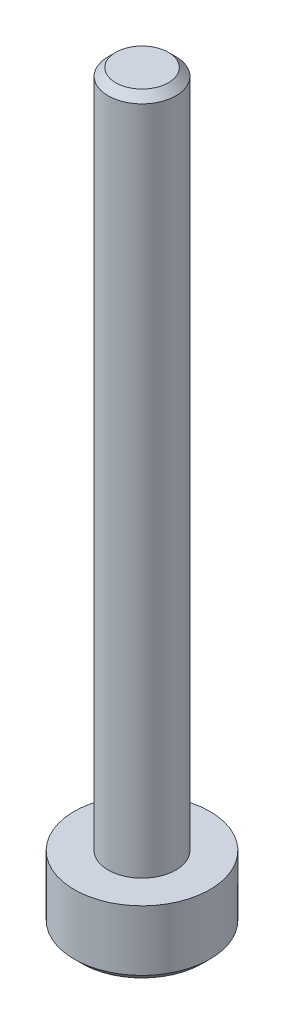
ISO-10303-21;
HEADER;
FILE_DESCRIPTION(('STEP AP214'),'2;1');
FILE_NAME('part.step','',(''),(''),'','','');
FILE_SCHEMA(('AUTOMOTIVE_DESIGN { 1 0 10303 214 1 1 1 1 }'));
ENDSEC;
DATA;
#1=APPLICATION_CONTEXT('core data for automotive mechanical design processes');
#2=APPLICATION_PROTOCOL_DEFINITION('international standard','automotive_design',2000,#1);
#3=PRODUCT_CONTEXT('',#1,'mechanical');
#4=PRODUCT('Part','Part','',(#3));
#5=PRODUCT_RELATED_PRODUCT_CATEGORY('part','',(#4));
#6=PRODUCT_DEFINITION_FORMATION('','',#4);
#7=PRODUCT_DEFINITION_CONTEXT('part definition',#1,'design');
#8=PRODUCT_DEFINITION('design','',#6,#7);
#9=PRODUCT_DEFINITION_SHAPE('','',#8);
#10=(LENGTH_UNIT() NAMED_UNIT(*) SI_UNIT(.MILLI.,.METRE.));
#11=(NAMED_UNIT(*) PLANE_ANGLE_UNIT() SI_UNIT($,.RADIAN.));
#12=(NAMED_UNIT(*) SI_UNIT($,.STERADIAN.) SOLID_ANGLE_UNIT());
#13=UNCERTAINTY_MEASURE_WITH_UNIT(LENGTH_MEASURE(1.E-05),#10,'distance_accuracy_value','');
#14=(GEOMETRIC_REPRESENTATION_CONTEXT(3) GLOBAL_UNCERTAINTY_ASSIGNED_CONTEXT((#13)) GLOBAL_UNIT_ASSIGNED_CONTEXT((#10,
#11,#12)) REPRESENTATION_CONTEXT('',''));
#15=CARTESIAN_POINT('',(0.,0.,0.));
#16=DIRECTION('',(0.,0.,1.));
#17=DIRECTION('',(1.,0.,0.));
#18=AXIS2_PLACEMENT_3D('',#15,#16,#17);
#19=CARTESIAN_POINT('',(0.,30.,0.));
#20=DIRECTION('',(0.,-1.,0.));
#21=DIRECTION('',(0.,0.,-1.));
#22=AXIS2_PLACEMENT_3D('',#19,#20,#21);
#23=CYLINDRICAL_SURFACE('',#22,1.5);
#24=CARTESIAN_POINT('',(0.,29.6666666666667,0.));
#25=DIRECTION('',(0.,1.,0.));
#26=DIRECTION('',(0.,0.,1.));
#27=AXIS2_PLACEMENT_3D('',#24,#25,#26);
#28=CIRCLE('',#27,1.5);
#29=CARTESIAN_POINT('',(0.,29.6666666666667,1.5));
#30=VERTEX_POINT('',#29);
#31=EDGE_CURVE('E160',#30,#30,#28,.F.);
#32=ORIENTED_EDGE('',*,*,#31,.T.);
#33=EDGE_LOOP('',(#32));
#34=FACE_BOUND('',#33,.T.);
#35=CARTESIAN_POINT('',(0.,0.,0.));
#36=DIRECTION('',(0.,1.,0.));
#37=DIRECTION('',(0.,0.,1.));
#38=AXIS2_PLACEMENT_3D('',#35,#36,#37);
#39=CIRCLE('',#38,1.5);
#40=CARTESIAN_POINT('',(0.,0.,1.5));
#41=VERTEX_POINT('',#40);
#42=EDGE_CURVE('E154',#41,#41,#39,.T.);
#43=ORIENTED_EDGE('',*,*,#42,.T.);
#44=EDGE_LOOP('',(#43));
#45=FACE_BOUND('',#44,.T.);
#46=ADVANCED_FACE('F43',(#34,#45),#23,.T.);
#47=CARTESIAN_POINT('',(0.,30.,0.));
#48=DIRECTION('',(0.,1.,0.));
#49=DIRECTION('',(0.,0.,1.));
#50=AXIS2_PLACEMENT_3D('',#47,#48,#49);
#51=PLANE('',#50);
#52=CARTESIAN_POINT('',(0.,30.,0.));
#53=DIRECTION('',(0.,1.,0.));
#54=DIRECTION('',(0.,0.,1.));
#55=AXIS2_PLACEMENT_3D('',#52,#53,#54);
#56=CIRCLE('',#55,1.16666666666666);
#57=CARTESIAN_POINT('',(0.,30.,1.16666666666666));
#58=VERTEX_POINT('',#57);
#59=EDGE_CURVE('E157',#58,#58,#56,.T.);
#60=ORIENTED_EDGE('',*,*,#59,.T.);
#61=EDGE_LOOP('',(#60));
#62=FACE_BOUND('',#61,.T.);
#63=ADVANCED_FACE('F177',(#62),#51,.T.);
#64=CARTESIAN_POINT('',(0.,-3.,0.));
#65=DIRECTION('',(0.,1.,0.));
#66=DIRECTION('',(0.,0.,1.));
#67=AXIS2_PLACEMENT_3D('',#64,#65,#66);
#68=CYLINDRICAL_SURFACE('',#67,3.);
#69=CARTESIAN_POINT('',(0.,-2.66666666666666,0.));
#70=DIRECTION('',(0.,-1.,0.));
#71=DIRECTION('',(0.,0.,-1.));
#72=AXIS2_PLACEMENT_3D('',#69,#70,#71);
#73=CIRCLE('',#72,3.);
#74=CARTESIAN_POINT('',(0.,-2.66666666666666,-3.));
#75=VERTEX_POINT('',#74);
#76=EDGE_CURVE('E11',#75,#75,#73,.F.);
#77=ORIENTED_EDGE('',*,*,#76,.T.);
#78=EDGE_LOOP('',(#77));
#79=FACE_BOUND('',#78,.T.);
#80=CARTESIAN_POINT('',(0.,0.,0.));
#81=DIRECTION('',(0.,-1.,0.));
#82=DIRECTION('',(0.,0.,-1.));
#83=AXIS2_PLACEMENT_3D('',#80,#81,#82);
#84=CIRCLE('',#83,3.);
#85=CARTESIAN_POINT('',(0.,0.,-3.));
#86=VERTEX_POINT('',#85);
#87=EDGE_CURVE('E146',#86,#86,#84,.T.);
#88=ORIENTED_EDGE('',*,*,#87,.T.);
#89=EDGE_LOOP('',(#88));
#90=FACE_BOUND('',#89,.T.);
#91=ADVANCED_FACE('F183',(#79,#90),#68,.T.);
#92=CARTESIAN_POINT('',(0.,-3.,0.));
#93=DIRECTION('',(0.,-1.,0.));
#94=DIRECTION('',(0.,0.,-1.));
#95=AXIS2_PLACEMENT_3D('',#92,#93,#94);
#96=PLANE('',#95);
#97=CARTESIAN_POINT('',(0.,-3.,0.));
#98=DIRECTION('',(0.,-1.,0.));
#99=DIRECTION('',(0.,0.,-1.));
#100=AXIS2_PLACEMENT_3D('',#97,#98,#99);
#101=CIRCLE('',#100,2.66666666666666);
#102=CARTESIAN_POINT('',(0.,-3.,-2.66666666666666));
#103=VERTEX_POINT('',#102);
#104=EDGE_CURVE('E52',#103,#103,#101,.T.);
#105=ORIENTED_EDGE('',*,*,#104,.T.);
#106=EDGE_LOOP('',(#105));
#107=FACE_BOUND('',#106,.T.);
#108=DIRECTION('',(-0.866025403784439,0.,0.5));
#109=VECTOR('',#108,1.);
#110=CARTESIAN_POINT('',(1.5,-3.,0.86602540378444));
#111=LINE('',#110,#109);
#112=CARTESIAN_POINT('',(1.5,-3.,0.86602540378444));
#113=VERTEX_POINT('',#112);
#114=CARTESIAN_POINT('',(0.,-3.,1.73205080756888));
#115=VERTEX_POINT('',#114);
#116=EDGE_CURVE('E59',#113,#115,#111,.T.);
#117=ORIENTED_EDGE('',*,*,#116,.F.);
#118=DIRECTION('',(0.,0.,1.));
#119=VECTOR('',#118,1.);
#120=CARTESIAN_POINT('',(1.5,-3.,-0.866025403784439));
#121=LINE('',#120,#119);
#122=CARTESIAN_POINT('',(1.5,-3.,-0.866025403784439));
#123=VERTEX_POINT('',#122);
#124=EDGE_CURVE('E142',#123,#113,#121,.T.);
#125=ORIENTED_EDGE('',*,*,#124,.F.);
#126=DIRECTION('',(0.866025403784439,0.,0.5));
#127=VECTOR('',#126,1.);
#128=CARTESIAN_POINT('',(0.,-3.,-1.73205080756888));
#129=LINE('',#128,#127);
#130=CARTESIAN_POINT('',(0.,-3.,-1.73205080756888));
#131=VERTEX_POINT('',#130);
#132=EDGE_CURVE('E140',#131,#123,#129,.T.);
#133=ORIENTED_EDGE('',*,*,#132,.F.);
#134=DIRECTION('',(0.866025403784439,0.,-0.5));
#135=VECTOR('',#134,1.);
#136=CARTESIAN_POINT('',(-1.5,-3.,-0.866025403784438));
#137=LINE('',#136,#135);
#138=CARTESIAN_POINT('',(-1.5,-3.,-0.866025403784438));
#139=VERTEX_POINT('',#138);
#140=EDGE_CURVE('E107',#139,#131,#137,.T.);
#141=ORIENTED_EDGE('',*,*,#140,.F.);
#142=DIRECTION('',(0.,0.,-1.));
#143=VECTOR('',#142,1.);
#144=CARTESIAN_POINT('',(-1.5,-3.,0.86602540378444));
#145=LINE('',#144,#143);
#146=CARTESIAN_POINT('',(-1.5,-3.,0.86602540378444));
#147=VERTEX_POINT('',#146);
#148=EDGE_CURVE('E136',#147,#139,#145,.T.);
#149=ORIENTED_EDGE('',*,*,#148,.F.);
#150=DIRECTION('',(-0.866025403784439,0.,-0.5));
#151=VECTOR('',#150,1.);
#152=CARTESIAN_POINT('',(0.,-3.,1.73205080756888));
#153=LINE('',#152,#151);
#154=EDGE_CURVE('E133',#115,#147,#153,.T.);
#155=ORIENTED_EDGE('',*,*,#154,.F.);
#156=EDGE_LOOP('',(#117,#125,#133,#141,#149,#155));
#157=FACE_BOUND('',#156,.T.);
#158=ADVANCED_FACE('F165',(#107,#157),#96,.T.);
#159=CARTESIAN_POINT('',(0.,0.,0.));
#160=DIRECTION('',(0.,-1.,0.));
#161=DIRECTION('',(0.,0.,-1.));
#162=AXIS2_PLACEMENT_3D('',#159,#160,#161);
#163=PLANE('',#162);
#164=ORIENTED_EDGE('',*,*,#42,.F.);
#165=EDGE_LOOP('',(#164));
#166=FACE_BOUND('',#165,.T.);
#167=ORIENTED_EDGE('',*,*,#87,.F.);
#168=EDGE_LOOP('',(#167));
#169=FACE_BOUND('',#168,.T.);
#170=ADVANCED_FACE('F196',(#166,#169),#163,.F.);
#171=CARTESIAN_POINT('',(1.5,-1.,0.86602540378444));
#172=DIRECTION('',(0.5,0.,0.866025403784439));
#173=DIRECTION('',(0.866025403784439,0.,-0.5));
#174=AXIS2_PLACEMENT_3D('',#171,#172,#173);
#175=PLANE('',#174);
#176=ORIENTED_EDGE('',*,*,#116,.T.);
#177=DIRECTION('',(0.,-1.,0.));
#178=VECTOR('',#177,1.);
#179=CARTESIAN_POINT('',(0.,-1.,1.73205080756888));
#180=LINE('',#179,#178);
#181=CARTESIAN_POINT('',(0.,-1.,1.73205080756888));
#182=VERTEX_POINT('',#181);
#183=EDGE_CURVE('E89',#182,#115,#180,.T.);
#184=ORIENTED_EDGE('',*,*,#183,.F.);
#185=DIRECTION('',(-0.866025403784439,0.,0.5));
#186=VECTOR('',#185,1.);
#187=CARTESIAN_POINT('',(1.5,-1.,0.86602540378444));
#188=LINE('',#187,#186);
#189=CARTESIAN_POINT('',(1.5,-1.,0.86602540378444));
#190=VERTEX_POINT('',#189);
#191=EDGE_CURVE('E144',#190,#182,#188,.T.);
#192=ORIENTED_EDGE('',*,*,#191,.F.);
#193=DIRECTION('',(0.,-1.,0.));
#194=VECTOR('',#193,1.);
#195=CARTESIAN_POINT('',(1.5,-1.,0.86602540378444));
#196=LINE('',#195,#194);
#197=EDGE_CURVE('E67',#190,#113,#196,.T.);
#198=ORIENTED_EDGE('',*,*,#197,.T.);
#199=EDGE_LOOP('',(#176,#184,#192,#198));
#200=FACE_BOUND('',#199,.T.);
#201=ADVANCED_FACE('F199',(#200),#175,.F.);
#202=CARTESIAN_POINT('',(1.5,-1.,-0.866025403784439));
#203=DIRECTION('',(1.,0.,0.));
#204=DIRECTION('',(0.,0.,-1.));
#205=AXIS2_PLACEMENT_3D('',#202,#203,#204);
#206=PLANE('',#205);
#207=ORIENTED_EDGE('',*,*,#124,.T.);
#208=ORIENTED_EDGE('',*,*,#197,.F.);
#209=DIRECTION('',(0.,0.,1.));
#210=VECTOR('',#209,1.);
#211=CARTESIAN_POINT('',(1.5,-1.,-0.866025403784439));
#212=LINE('',#211,#210);
#213=CARTESIAN_POINT('',(1.5,-1.,-0.866025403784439));
#214=VERTEX_POINT('',#213);
#215=EDGE_CURVE('E119',#214,#190,#212,.T.);
#216=ORIENTED_EDGE('',*,*,#215,.F.);
#217=DIRECTION('',(0.,-1.,0.));
#218=VECTOR('',#217,1.);
#219=CARTESIAN_POINT('',(1.5,-1.,-0.866025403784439));
#220=LINE('',#219,#218);
#221=EDGE_CURVE('E111',#214,#123,#220,.T.);
#222=ORIENTED_EDGE('',*,*,#221,.T.);
#223=EDGE_LOOP('',(#207,#208,#216,#222));
#224=FACE_BOUND('',#223,.T.);
#225=ADVANCED_FACE('F205',(#224),#206,.F.);
#226=CARTESIAN_POINT('',(0.,-1.,-1.73205080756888));
#227=DIRECTION('',(0.5,0.,-0.866025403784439));
#228=DIRECTION('',(-0.866025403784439,0.,-0.5));
#229=AXIS2_PLACEMENT_3D('',#226,#227,#228);
#230=PLANE('',#229);
#231=ORIENTED_EDGE('',*,*,#132,.T.);
#232=ORIENTED_EDGE('',*,*,#221,.F.);
#233=DIRECTION('',(0.866025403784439,0.,0.5));
#234=VECTOR('',#233,1.);
#235=CARTESIAN_POINT('',(0.,-1.,-1.73205080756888));
#236=LINE('',#235,#234);
#237=CARTESIAN_POINT('',(0.,-1.,-1.73205080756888));
#238=VERTEX_POINT('',#237);
#239=EDGE_CURVE('E115',#238,#214,#236,.T.);
#240=ORIENTED_EDGE('',*,*,#239,.F.);
#241=DIRECTION('',(0.,-1.,0.));
#242=VECTOR('',#241,1.);
#243=CARTESIAN_POINT('',(0.,-1.,-1.73205080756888));
#244=LINE('',#243,#242);
#245=EDGE_CURVE('E100',#238,#131,#244,.T.);
#246=ORIENTED_EDGE('',*,*,#245,.T.);
#247=EDGE_LOOP('',(#231,#232,#240,#246));
#248=FACE_BOUND('',#247,.T.);
#249=ADVANCED_FACE('F116',(#248),#230,.F.);
#250=CARTESIAN_POINT('',(-1.5,-1.,-0.866025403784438));
#251=DIRECTION('',(-0.5,0.,-0.866025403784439));
#252=DIRECTION('',(-0.866025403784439,0.,0.5));
#253=AXIS2_PLACEMENT_3D('',#250,#251,#252);
#254=PLANE('',#253);
#255=ORIENTED_EDGE('',*,*,#140,.T.);
#256=ORIENTED_EDGE('',*,*,#245,.F.);
#257=DIRECTION('',(0.866025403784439,0.,-0.5));
#258=VECTOR('',#257,1.);
#259=CARTESIAN_POINT('',(-1.5,-1.,-0.866025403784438));
#260=LINE('',#259,#258);
#261=CARTESIAN_POINT('',(-1.5,-1.,-0.866025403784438));
#262=VERTEX_POINT('',#261);
#263=EDGE_CURVE('E104',#262,#238,#260,.T.);
#264=ORIENTED_EDGE('',*,*,#263,.F.);
#265=DIRECTION('',(0.,-1.,0.));
#266=VECTOR('',#265,1.);
#267=CARTESIAN_POINT('',(-1.5,-1.,-0.866025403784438));
#268=LINE('',#267,#266);
#269=EDGE_CURVE('E112',#262,#139,#268,.T.);
#270=ORIENTED_EDGE('',*,*,#269,.T.);
#271=EDGE_LOOP('',(#255,#256,#264,#270));
#272=FACE_BOUND('',#271,.T.);
#273=ADVANCED_FACE('F102',(#272),#254,.F.);
#274=CARTESIAN_POINT('',(-1.5,-1.,0.86602540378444));
#275=DIRECTION('',(-1.,0.,0.));
#276=DIRECTION('',(0.,0.,1.));
#277=AXIS2_PLACEMENT_3D('',#274,#275,#276);
#278=PLANE('',#277);
#279=ORIENTED_EDGE('',*,*,#148,.T.);
#280=ORIENTED_EDGE('',*,*,#269,.F.);
#281=DIRECTION('',(0.,0.,-1.));
#282=VECTOR('',#281,1.);
#283=CARTESIAN_POINT('',(-1.5,-1.,0.86602540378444));
#284=LINE('',#283,#282);
#285=CARTESIAN_POINT('',(-1.5,-1.,0.86602540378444));
#286=VERTEX_POINT('',#285);
#287=EDGE_CURVE('E125',#286,#262,#284,.T.);
#288=ORIENTED_EDGE('',*,*,#287,.F.);
#289=DIRECTION('',(0.,-1.,0.));
#290=VECTOR('',#289,1.);
#291=CARTESIAN_POINT('',(-1.5,-1.,0.86602540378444));
#292=LINE('',#291,#290);
#293=EDGE_CURVE('E149',#286,#147,#292,.T.);
#294=ORIENTED_EDGE('',*,*,#293,.T.);
#295=EDGE_LOOP('',(#279,#280,#288,#294));
#296=FACE_BOUND('',#295,.T.);
#297=ADVANCED_FACE('F209',(#296),#278,.F.);
#298=CARTESIAN_POINT('',(0.,-1.,1.73205080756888));
#299=DIRECTION('',(-0.5,0.,0.866025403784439));
#300=DIRECTION('',(0.866025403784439,0.,0.5));
#301=AXIS2_PLACEMENT_3D('',#298,#299,#300);
#302=PLANE('',#301);
#303=ORIENTED_EDGE('',*,*,#154,.T.);
#304=ORIENTED_EDGE('',*,*,#293,.F.);
#305=DIRECTION('',(-0.866025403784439,0.,-0.5));
#306=VECTOR('',#305,1.);
#307=CARTESIAN_POINT('',(0.,-1.,1.73205080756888));
#308=LINE('',#307,#306);
#309=EDGE_CURVE('E127',#182,#286,#308,.T.);
#310=ORIENTED_EDGE('',*,*,#309,.F.);
#311=ORIENTED_EDGE('',*,*,#183,.T.);
#312=EDGE_LOOP('',(#303,#304,#310,#311));
#313=FACE_BOUND('',#312,.T.);
#314=ADVANCED_FACE('F206',(#313),#302,.F.);
#315=CARTESIAN_POINT('',(0.,-1.,0.));
#316=DIRECTION('',(0.,-1.,0.));
#317=DIRECTION('',(0.,0.,-1.));
#318=AXIS2_PLACEMENT_3D('',#315,#316,#317);
#319=PLANE('',#318);
#320=ORIENTED_EDGE('',*,*,#191,.T.);
#321=ORIENTED_EDGE('',*,*,#309,.T.);
#322=ORIENTED_EDGE('',*,*,#287,.T.);
#323=ORIENTED_EDGE('',*,*,#263,.T.);
#324=ORIENTED_EDGE('',*,*,#239,.T.);
#325=ORIENTED_EDGE('',*,*,#215,.T.);
#326=EDGE_LOOP('',(#320,#321,#322,#323,#324,#325));
#327=FACE_BOUND('',#326,.T.);
#328=ADVANCED_FACE('F122',(#327),#319,.T.);
#329=CARTESIAN_POINT('',(0.,30.,0.));
#330=DIRECTION('',(0.,-1.,0.));
#331=DIRECTION('',(0.,0.,-1.));
#332=AXIS2_PLACEMENT_3D('',#329,#330,#331);
#333=CONICAL_SURFACE('',#332,1.16666666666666,0.785398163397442);
#334=ORIENTED_EDGE('',*,*,#31,.F.);
#335=EDGE_LOOP('',(#334));
#336=FACE_BOUND('',#335,.T.);
#337=ORIENTED_EDGE('',*,*,#59,.F.);
#338=EDGE_LOOP('',(#337));
#339=FACE_BOUND('',#338,.T.);
#340=ADVANCED_FACE('F169',(#336,#339),#333,.T.);
#341=CARTESIAN_POINT('',(0.,-3.,0.));
#342=DIRECTION('',(0.,1.,0.));
#343=DIRECTION('',(0.,0.,1.));
#344=AXIS2_PLACEMENT_3D('',#341,#342,#343);
#345=CONICAL_SURFACE('',#344,2.66666666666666,0.785398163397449);
#346=ORIENTED_EDGE('',*,*,#76,.F.);
#347=EDGE_LOOP('',(#346));
#348=FACE_BOUND('',#347,.T.);
#349=ORIENTED_EDGE('',*,*,#104,.F.);
#350=EDGE_LOOP('',(#349));
#351=FACE_BOUND('',#350,.T.);
#352=ADVANCED_FACE('F46',(#348,#351),#345,.T.);
#353=CLOSED_SHELL('',(#46,#63,#91,#158,#170,#201,#225,#249,#273,#297,#314,#328,#340,#352));
#354=MANIFOLD_SOLID_BREP('B2',#353);
#355=ADVANCED_BREP_SHAPE_REPRESENTATION('',(#18,#354),#14);
#356=SHAPE_DEFINITION_REPRESENTATION(#9,#355);
ENDSEC;
END-ISO-10303-21;
